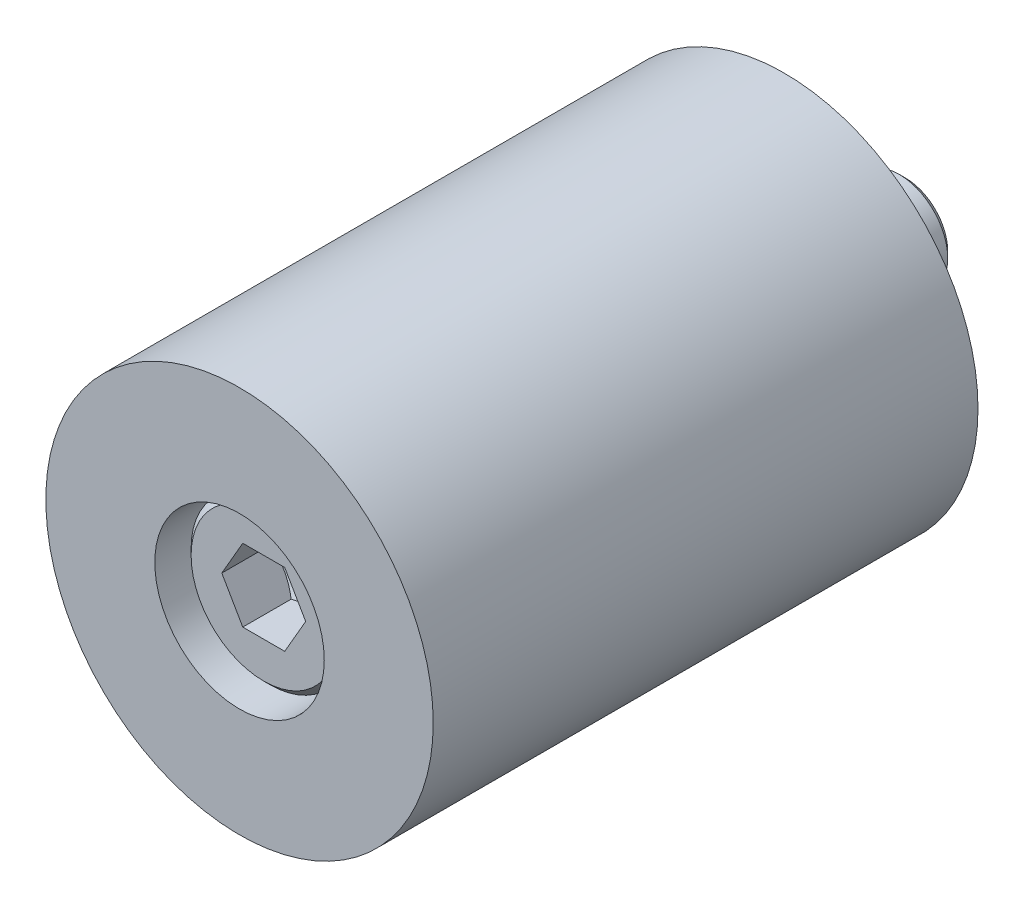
ISO-10303-21;
HEADER;
FILE_DESCRIPTION(('STEP AP214'),'2;1');
FILE_NAME('part.step','',(''),(''),'','','');
FILE_SCHEMA(('AUTOMOTIVE_DESIGN { 1 0 10303 214 1 1 1 1 }'));
ENDSEC;
DATA;
#1=APPLICATION_CONTEXT('core data for automotive mechanical design processes');
#2=APPLICATION_PROTOCOL_DEFINITION('international standard','automotive_design',2000,#1);
#3=PRODUCT_CONTEXT('',#1,'mechanical');
#4=PRODUCT('Part','Part','',(#3));
#5=PRODUCT_RELATED_PRODUCT_CATEGORY('part','',(#4));
#6=PRODUCT_DEFINITION_FORMATION('','',#4);
#7=PRODUCT_DEFINITION_CONTEXT('part definition',#1,'design');
#8=PRODUCT_DEFINITION('design','',#6,#7);
#9=PRODUCT_DEFINITION_SHAPE('','',#8);
#10=(LENGTH_UNIT() NAMED_UNIT(*) SI_UNIT(.MILLI.,.METRE.));
#11=(NAMED_UNIT(*) PLANE_ANGLE_UNIT() SI_UNIT($,.RADIAN.));
#12=(NAMED_UNIT(*) SI_UNIT($,.STERADIAN.) SOLID_ANGLE_UNIT());
#13=UNCERTAINTY_MEASURE_WITH_UNIT(LENGTH_MEASURE(1.E-05),#10,'distance_accuracy_value','');
#14=(GEOMETRIC_REPRESENTATION_CONTEXT(3) GLOBAL_UNCERTAINTY_ASSIGNED_CONTEXT((#13)) GLOBAL_UNIT_ASSIGNED_CONTEXT((#10,
#11,#12)) REPRESENTATION_CONTEXT('',''));
#15=CARTESIAN_POINT('',(0.,0.,0.));
#16=DIRECTION('',(0.,0.,1.));
#17=DIRECTION('',(1.,0.,0.));
#18=AXIS2_PLACEMENT_3D('',#15,#16,#17);
#19=CARTESIAN_POINT('',(0.,0.,22.5));
#20=DIRECTION('',(0.,0.,-1.));
#21=DIRECTION('',(1.,0.,0.));
#22=AXIS2_PLACEMENT_3D('',#19,#20,#21);
#23=CYLINDRICAL_SURFACE('',#22,4.25);
#24=CARTESIAN_POINT('',(0.,0.,35.));
#25=DIRECTION('',(0.,0.,1.));
#26=DIRECTION('',(-1.,0.,0.));
#27=AXIS2_PLACEMENT_3D('',#24,#25,#26);
#28=CIRCLE('',#27,4.25);
#29=CARTESIAN_POINT('',(-4.25,0.,35.));
#30=VERTEX_POINT('',#29);
#31=CARTESIAN_POINT('',(4.25,0.,35.));
#32=VERTEX_POINT('',#31);
#33=EDGE_CURVE('P0_E36',#30,#32,#28,.T.);
#34=ORIENTED_EDGE('',*,*,#33,.T.);
#35=CARTESIAN_POINT('',(4.25,0.,35.0000013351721));
#36=CARTESIAN_POINT('',(4.25,0.,4.55130932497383E-07));
#37=B_SPLINE_CURVE_WITH_KNOTS('',1,(#35,#36),.UNSPECIFIED.,.F.,.F.,(2,2),(0.0833333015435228,
0.916666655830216),.UNSPECIFIED.);
#38=CARTESIAN_POINT('',(4.25,0.,0.));
#39=VERTEX_POINT('',#38);
#40=EDGE_CURVE('P0_E25',#32,#39,#37,.T.);
#41=ORIENTED_EDGE('',*,*,#40,.T.);
#42=CARTESIAN_POINT('',(0.,0.,0.));
#43=DIRECTION('',(0.,0.,1.));
#44=DIRECTION('',(1.,0.,0.));
#45=AXIS2_PLACEMENT_3D('',#42,#43,#44);
#46=CIRCLE('',#45,4.25);
#47=EDGE_CURVE('P0_E11',#39,#39,#46,.T.);
#48=ORIENTED_EDGE('',*,*,#47,.F.);
#49=ORIENTED_EDGE('',*,*,#40,.F.);
#50=CARTESIAN_POINT('',(0.,0.,35.));
#51=DIRECTION('',(0.,0.,1.));
#52=DIRECTION('',(-1.,0.,0.));
#53=AXIS2_PLACEMENT_3D('',#50,#51,#52);
#54=CIRCLE('',#53,4.25);
#55=EDGE_CURVE('P0_E51',#32,#30,#54,.T.);
#56=ORIENTED_EDGE('',*,*,#55,.T.);
#57=EDGE_LOOP('',(#34,#41,#48,#49,#56));
#58=FACE_BOUND('',#57,.T.);
#59=ADVANCED_FACE('P0_F16',(#58),#23,.F.);
#60=CARTESIAN_POINT('',(0.,0.,40.));
#61=DIRECTION('',(0.,0.,-1.));
#62=DIRECTION('',(1.,0.,0.));
#63=AXIS2_PLACEMENT_3D('',#60,#61,#62);
#64=CYLINDRICAL_SURFACE('',#63,7.);
#65=CARTESIAN_POINT('',(0.,0.,45.));
#66=DIRECTION('',(0.,0.,-1.));
#67=DIRECTION('',(1.,0.,0.));
#68=AXIS2_PLACEMENT_3D('',#65,#66,#67);
#69=CIRCLE('',#68,7.);
#70=CARTESIAN_POINT('',(7.,0.,45.));
#71=VERTEX_POINT('',#70);
#72=EDGE_CURVE('P0_E53',#71,#71,#69,.T.);
#73=ORIENTED_EDGE('',*,*,#72,.F.);
#74=CARTESIAN_POINT('',(7.,0.,45.0000015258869));
#75=CARTESIAN_POINT('',(7.,0.,35.0000012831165));
#76=B_SPLINE_CURVE_WITH_KNOTS('',1,(#74,#75),.UNSPECIFIED.,.F.,.F.,(2,2),(0.0833332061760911,
0.916666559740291),.UNSPECIFIED.);
#77=CARTESIAN_POINT('',(7.,0.,35.));
#78=VERTEX_POINT('',#77);
#79=EDGE_CURVE('P0_E91',#71,#78,#76,.T.);
#80=ORIENTED_EDGE('',*,*,#79,.T.);
#81=CARTESIAN_POINT('',(0.,0.,35.));
#82=DIRECTION('',(0.,0.,-1.));
#83=DIRECTION('',(1.,0.,0.));
#84=AXIS2_PLACEMENT_3D('',#81,#82,#83);
#85=CIRCLE('',#84,7.);
#86=EDGE_CURVE('P0_E94',#78,#78,#85,.T.);
#87=ORIENTED_EDGE('',*,*,#86,.T.);
#88=ORIENTED_EDGE('',*,*,#79,.F.);
#89=EDGE_LOOP('',(#73,#80,#87,#88));
#90=FACE_BOUND('',#89,.T.);
#91=ADVANCED_FACE('P0_F111',(#90),#64,.F.);
#92=CARTESIAN_POINT('',(-16.1,14.5492267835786,35.));
#93=DIRECTION('',(0.,0.,-1.));
#94=DIRECTION('',(1.,0.,0.));
#95=AXIS2_PLACEMENT_3D('',#92,#93,#94);
#96=PLANE('',#95);
#97=ORIENTED_EDGE('',*,*,#86,.F.);
#98=EDGE_LOOP('',(#97));
#99=FACE_BOUND('',#98,.T.);
#100=ORIENTED_EDGE('',*,*,#55,.F.);
#101=ORIENTED_EDGE('',*,*,#33,.F.);
#102=EDGE_LOOP('',(#100,#101));
#103=FACE_BOUND('',#102,.T.);
#104=ADVANCED_FACE('P0_F55',(#99,#103),#96,.F.);
#105=CARTESIAN_POINT('',(0.,0.,22.5));
#106=DIRECTION('',(0.,0.,1.));
#107=DIRECTION('',(1.,0.,0.));
#108=AXIS2_PLACEMENT_3D('',#105,#106,#107);
#109=CYLINDRICAL_SURFACE('',#108,16.);
#110=CARTESIAN_POINT('',(0.,0.,0.));
#111=DIRECTION('',(0.,0.,-1.));
#112=DIRECTION('',(1.,0.,0.));
#113=AXIS2_PLACEMENT_3D('',#110,#111,#112);
#114=CIRCLE('',#113,16.);
#115=CARTESIAN_POINT('',(16.,0.,0.));
#116=VERTEX_POINT('',#115);
#117=EDGE_CURVE('P0_E85',#116,#116,#114,.T.);
#118=ORIENTED_EDGE('',*,*,#117,.F.);
#119=CARTESIAN_POINT('',(16.,0.,8.58270883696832E-07));
#120=CARTESIAN_POINT('',(16.,0.,44.9999996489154));
#121=B_SPLINE_CURVE_WITH_KNOTS('',1,(#119,#120),.UNSPECIFIED.,.F.,.F.,(2,2),(0.0833333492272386,
0.916666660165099),.UNSPECIFIED.);
#122=CARTESIAN_POINT('',(16.,0.,45.));
#123=VERTEX_POINT('',#122);
#124=EDGE_CURVE('P0_E57',#116,#123,#121,.T.);
#125=ORIENTED_EDGE('',*,*,#124,.T.);
#126=CARTESIAN_POINT('',(0.,0.,45.));
#127=DIRECTION('',(0.,0.,1.));
#128=DIRECTION('',(1.,0.,0.));
#129=AXIS2_PLACEMENT_3D('',#126,#127,#128);
#130=CIRCLE('',#129,16.);
#131=EDGE_CURVE('P0_E82',#123,#123,#130,.T.);
#132=ORIENTED_EDGE('',*,*,#131,.F.);
#133=ORIENTED_EDGE('',*,*,#124,.F.);
#134=EDGE_LOOP('',(#118,#125,#132,#133));
#135=FACE_BOUND('',#134,.T.);
#136=ADVANCED_FACE('P0_F130',(#135),#109,.T.);
#137=CARTESIAN_POINT('',(20.8,-33.2553755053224,0.));
#138=DIRECTION('',(0.,0.,-1.));
#139=DIRECTION('',(-1.,0.,0.));
#140=AXIS2_PLACEMENT_3D('',#137,#138,#139);
#141=PLANE('',#140);
#142=ORIENTED_EDGE('',*,*,#117,.T.);
#143=EDGE_LOOP('',(#142));
#144=FACE_BOUND('',#143,.T.);
#145=ORIENTED_EDGE('',*,*,#47,.T.);
#146=EDGE_LOOP('',(#145));
#147=FACE_BOUND('',#146,.T.);
#148=ADVANCED_FACE('P0_F132',(#144,#147),#141,.T.);
#149=CARTESIAN_POINT('',(-36.8,-33.2553755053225,45.));
#150=DIRECTION('',(0.,0.,1.));
#151=DIRECTION('',(1.,0.,0.));
#152=AXIS2_PLACEMENT_3D('',#149,#150,#151);
#153=PLANE('',#152);
#154=ORIENTED_EDGE('',*,*,#131,.T.);
#155=EDGE_LOOP('',(#154));
#156=FACE_BOUND('',#155,.T.);
#157=ORIENTED_EDGE('',*,*,#72,.T.);
#158=EDGE_LOOP('',(#157));
#159=FACE_BOUND('',#158,.T.);
#160=ADVANCED_FACE('P0_F108',(#156,#159),#153,.T.);
#161=CLOSED_SHELL('',(#59,#91,#104,#136,#148,#160));
#162=MANIFOLD_SOLID_BREP('P0_B1',#161);
#163=CARTESIAN_POINT('',(0.,0.,-7.84314575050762));
#164=DIRECTION('',(0.,0.,1.));
#165=DIRECTION('',(-1.,0.,0.));
#166=AXIS2_PLACEMENT_3D('',#163,#164,#165);
#167=CONICAL_SURFACE('',#166,5.65685424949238,0.785398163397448);
#168=CARTESIAN_POINT('',(0.,0.,-10.));
#169=DIRECTION('',(0.,0.,1.));
#170=DIRECTION('',(1.,0.,0.));
#171=AXIS2_PLACEMENT_3D('',#168,#169,#170);
#172=CIRCLE('',#171,3.5);
#173=CARTESIAN_POINT('',(3.5,0.,-10.));
#174=VERTEX_POINT('',#173);
#175=CARTESIAN_POINT('',(-3.5,0.,-10.));
#176=VERTEX_POINT('',#175);
#177=EDGE_CURVE('P1_E37',#174,#176,#172,.T.);
#178=ORIENTED_EDGE('',*,*,#177,.T.);
#179=CARTESIAN_POINT('',(-3.50000107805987,0.,-9.99999892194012));
#180=CARTESIAN_POINT('',(-3.9999982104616,0.,-9.5000017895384));
#181=B_SPLINE_CURVE_WITH_KNOTS('',1,(#179,#180),.UNSPECIFIED.,.F.,.F.,(2,2),(0.618718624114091,
0.707106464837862),.UNSPECIFIED.);
#182=CARTESIAN_POINT('',(-4.,0.,-9.5));
#183=VERTEX_POINT('',#182);
#184=EDGE_CURVE('P1_E24',#176,#183,#181,.T.);
#185=ORIENTED_EDGE('',*,*,#184,.T.);
#186=CARTESIAN_POINT('',(0.,0.,-9.5));
#187=DIRECTION('',(0.,0.,-1.));
#188=DIRECTION('',(1.,0.,0.));
#189=AXIS2_PLACEMENT_3D('',#186,#187,#188);
#190=CIRCLE('',#189,4.);
#191=CARTESIAN_POINT('',(4.,0.,-9.5));
#192=VERTEX_POINT('',#191);
#193=EDGE_CURVE('P1_E173',#183,#192,#190,.T.);
#194=ORIENTED_EDGE('',*,*,#193,.T.);
#195=CARTESIAN_POINT('',(0.,0.,-9.5));
#196=DIRECTION('',(0.,0.,-1.));
#197=DIRECTION('',(1.,0.,0.));
#198=AXIS2_PLACEMENT_3D('',#195,#196,#197);
#199=CIRCLE('',#198,4.);
#200=EDGE_CURVE('P1_E10',#192,#183,#199,.T.);
#201=ORIENTED_EDGE('',*,*,#200,.T.);
#202=ORIENTED_EDGE('',*,*,#184,.F.);
#203=CARTESIAN_POINT('',(0.,0.,-10.));
#204=DIRECTION('',(0.,0.,1.));
#205=DIRECTION('',(1.,0.,0.));
#206=AXIS2_PLACEMENT_3D('',#203,#204,#205);
#207=CIRCLE('',#206,3.5);
#208=EDGE_CURVE('P1_E146',#176,#174,#207,.T.);
#209=ORIENTED_EDGE('',*,*,#208,.T.);
#210=EDGE_LOOP('',(#178,#185,#194,#201,#202,#209));
#211=FACE_BOUND('',#210,.T.);
#212=ADVANCED_FACE('P1_F15',(#211),#167,.T.);
#213=CARTESIAN_POINT('',(0.,0.,12.5));
#214=DIRECTION('',(0.,0.,-1.));
#215=DIRECTION('',(1.,0.,0.));
#216=AXIS2_PLACEMENT_3D('',#213,#214,#215);
#217=CYLINDRICAL_SURFACE('',#216,4.);
#218=CARTESIAN_POINT('',(0.,0.,35.));
#219=DIRECTION('',(0.,0.,1.));
#220=DIRECTION('',(1.,0.,0.));
#221=AXIS2_PLACEMENT_3D('',#218,#219,#220);
#222=CIRCLE('',#221,4.);
#223=CARTESIAN_POINT('',(4.,0.,35.));
#224=VERTEX_POINT('',#223);
#225=EDGE_CURVE('P1_E154',#224,#224,#222,.T.);
#226=ORIENTED_EDGE('',*,*,#225,.F.);
#227=CARTESIAN_POINT('',(4.,0.,34.9999991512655));
#228=CARTESIAN_POINT('',(4.,0.,-9.49999965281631));
#229=B_SPLINE_CURVE_WITH_KNOTS('',1,(#227,#228),.UNSPECIFIED.,.F.,.F.,(2,2),(0.0833333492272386,
0.916666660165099),.UNSPECIFIED.);
#230=EDGE_CURVE('P1_E127',#224,#192,#229,.T.);
#231=ORIENTED_EDGE('',*,*,#230,.T.);
#232=ORIENTED_EDGE('',*,*,#193,.F.);
#233=ORIENTED_EDGE('',*,*,#200,.F.);
#234=ORIENTED_EDGE('',*,*,#230,.F.);
#235=EDGE_LOOP('',(#226,#231,#232,#233,#234));
#236=FACE_BOUND('',#235,.T.);
#237=ADVANCED_FACE('P1_F337',(#236),#217,.T.);
#238=CARTESIAN_POINT('',(-8.05,7.27461339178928,-10.));
#239=DIRECTION('',(0.,0.,-1.));
#240=DIRECTION('',(1.,0.,0.));
#241=AXIS2_PLACEMENT_3D('',#238,#239,#240);
#242=PLANE('',#241);
#243=ORIENTED_EDGE('',*,*,#208,.F.);
#244=ORIENTED_EDGE('',*,*,#177,.F.);
#245=EDGE_LOOP('',(#243,#244));
#246=FACE_BOUND('',#245,.T.);
#247=ADVANCED_FACE('P1_F340',(#246),#242,.T.);
#248=CARTESIAN_POINT('',(0.,0.,39.8076118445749));
#249=DIRECTION('',(0.,0.,-1.));
#250=DIRECTION('',(-1.,0.,0.));
#251=AXIS2_PLACEMENT_3D('',#248,#249,#250);
#252=CONICAL_SURFACE('',#251,9.19238815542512,0.785398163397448);
#253=CARTESIAN_POINT('',(0.,0.,43.));
#254=DIRECTION('',(0.,0.,-1.));
#255=DIRECTION('',(1.,0.,0.));
#256=AXIS2_PLACEMENT_3D('',#253,#254,#255);
#257=CIRCLE('',#256,6.);
#258=CARTESIAN_POINT('',(6.,0.,43.));
#259=VERTEX_POINT('',#258);
#260=CARTESIAN_POINT('',(-6.,0.,43.));
#261=VERTEX_POINT('',#260);
#262=EDGE_CURVE('P1_E102',#259,#261,#257,.T.);
#263=ORIENTED_EDGE('',*,*,#262,.T.);
#264=CARTESIAN_POINT('',(-6.00000188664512,0.,42.9999981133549));
#265=CARTESIAN_POINT('',(-6.50000263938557,0.,42.4999973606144));
#266=B_SPLINE_CURVE_WITH_KNOTS('',1,(#264,#265),.UNSPECIFIED.,.F.,.F.,(2,2),(0.652714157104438,
0.707107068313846),.UNSPECIFIED.);
#267=CARTESIAN_POINT('',(-6.5,0.,42.5));
#268=VERTEX_POINT('',#267);
#269=EDGE_CURVE('P1_E107',#261,#268,#266,.T.);
#270=ORIENTED_EDGE('',*,*,#269,.T.);
#271=CARTESIAN_POINT('',(0.,0.,42.5));
#272=DIRECTION('',(0.,0.,1.));
#273=DIRECTION('',(1.,0.,0.));
#274=AXIS2_PLACEMENT_3D('',#271,#272,#273);
#275=CIRCLE('',#274,6.5);
#276=CARTESIAN_POINT('',(6.5,0.,42.5));
#277=VERTEX_POINT('',#276);
#278=EDGE_CURVE('P1_E117',#268,#277,#275,.T.);
#279=ORIENTED_EDGE('',*,*,#278,.T.);
#280=CARTESIAN_POINT('',(0.,0.,42.5));
#281=DIRECTION('',(0.,0.,1.));
#282=DIRECTION('',(1.,0.,0.));
#283=AXIS2_PLACEMENT_3D('',#280,#281,#282);
#284=CIRCLE('',#283,6.5);
#285=EDGE_CURVE('P1_E119',#277,#268,#284,.T.);
#286=ORIENTED_EDGE('',*,*,#285,.T.);
#287=ORIENTED_EDGE('',*,*,#269,.F.);
#288=CARTESIAN_POINT('',(0.,0.,43.));
#289=DIRECTION('',(0.,0.,-1.));
#290=DIRECTION('',(1.,0.,0.));
#291=AXIS2_PLACEMENT_3D('',#288,#289,#290);
#292=CIRCLE('',#291,6.);
#293=EDGE_CURVE('P1_E109',#261,#259,#292,.T.);
#294=ORIENTED_EDGE('',*,*,#293,.T.);
#295=EDGE_LOOP('',(#263,#270,#279,#286,#287,#294));
#296=FACE_BOUND('',#295,.T.);
#297=ADVANCED_FACE('P1_F104',(#296),#252,.T.);
#298=CARTESIAN_POINT('',(0.,0.,39.));
#299=DIRECTION('',(0.,0.,1.));
#300=DIRECTION('',(1.,0.,0.));
#301=AXIS2_PLACEMENT_3D('',#298,#299,#300);
#302=CYLINDRICAL_SURFACE('',#301,6.5);
#303=CARTESIAN_POINT('',(0.,0.,35.));
#304=DIRECTION('',(0.,0.,-1.));
#305=DIRECTION('',(1.,0.,0.));
#306=AXIS2_PLACEMENT_3D('',#303,#304,#305);
#307=CIRCLE('',#306,6.5);
#308=CARTESIAN_POINT('',(6.5,0.,35.));
#309=VERTEX_POINT('',#308);
#310=EDGE_CURVE('P1_E112',#309,#309,#307,.T.);
#311=ORIENTED_EDGE('',*,*,#310,.F.);
#312=CARTESIAN_POINT('',(6.5,0.,35.0000038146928));
#313=CARTESIAN_POINT('',(6.5,0.,42.499997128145));
#314=B_SPLINE_CURVE_WITH_KNOTS('',1,(#312,#313),.UNSPECIFIED.,.F.,.F.,(2,2),(0.0833337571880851,
0.916666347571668),.UNSPECIFIED.);
#315=EDGE_CURVE('P1_E317',#309,#277,#314,.T.);
#316=ORIENTED_EDGE('',*,*,#315,.T.);
#317=ORIENTED_EDGE('',*,*,#278,.F.);
#318=ORIENTED_EDGE('',*,*,#285,.F.);
#319=ORIENTED_EDGE('',*,*,#315,.F.);
#320=EDGE_LOOP('',(#311,#316,#317,#318,#319));
#321=FACE_BOUND('',#320,.T.);
#322=ADVANCED_FACE('P1_F348',(#321),#302,.T.);
#323=CARTESIAN_POINT('',(-13.8,-12.4707658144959,43.));
#324=DIRECTION('',(0.,0.,1.));
#325=DIRECTION('',(1.,0.,0.));
#326=AXIS2_PLACEMENT_3D('',#323,#324,#325);
#327=PLANE('',#326);
#328=ORIENTED_EDGE('',*,*,#293,.F.);
#329=ORIENTED_EDGE('',*,*,#262,.F.);
#330=EDGE_LOOP('',(#328,#329));
#331=FACE_BOUND('',#330,.T.);
#332=DIRECTION('',(-0.500000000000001,0.866025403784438,0.));
#333=VECTOR('',#332,1.);
#334=CARTESIAN_POINT('',(-1.73205080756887,-3.,43.));
#335=LINE('',#334,#333);
#336=CARTESIAN_POINT('',(-1.73205080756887,-3.,43.));
#337=VERTEX_POINT('',#336);
#338=CARTESIAN_POINT('',(-3.46410161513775,0.,43.));
#339=VERTEX_POINT('',#338);
#340=EDGE_CURVE('P1_E312',#337,#339,#335,.T.);
#341=ORIENTED_EDGE('',*,*,#340,.T.);
#342=DIRECTION('',(0.5,0.866025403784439,0.));
#343=VECTOR('',#342,1.);
#344=CARTESIAN_POINT('',(-3.46410161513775,0.,43.));
#345=LINE('',#344,#343);
#346=CARTESIAN_POINT('',(-1.73205080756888,3.,43.));
#347=VERTEX_POINT('',#346);
#348=EDGE_CURVE('P1_E306',#339,#347,#345,.T.);
#349=ORIENTED_EDGE('',*,*,#348,.T.);
#350=DIRECTION('',(1.,0.,0.));
#351=VECTOR('',#350,1.);
#352=CARTESIAN_POINT('',(-1.73205080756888,3.,43.));
#353=LINE('',#352,#351);
#354=CARTESIAN_POINT('',(1.73205080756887,3.,43.));
#355=VERTEX_POINT('',#354);
#356=EDGE_CURVE('P1_E300',#347,#355,#353,.T.);
#357=ORIENTED_EDGE('',*,*,#356,.T.);
#358=DIRECTION('',(0.500000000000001,-0.866025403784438,0.));
#359=VECTOR('',#358,1.);
#360=CARTESIAN_POINT('',(1.73205080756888,3.,43.));
#361=LINE('',#360,#359);
#362=CARTESIAN_POINT('',(3.46410161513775,0.,43.));
#363=VERTEX_POINT('',#362);
#364=EDGE_CURVE('P1_E294',#355,#363,#361,.T.);
#365=ORIENTED_EDGE('',*,*,#364,.T.);
#366=DIRECTION('',(-0.499999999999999,-0.866025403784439,0.));
#367=VECTOR('',#366,1.);
#368=CARTESIAN_POINT('',(3.46410161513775,0.,43.));
#369=LINE('',#368,#367);
#370=CARTESIAN_POINT('',(1.73205080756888,-3.,43.));
#371=VERTEX_POINT('',#370);
#372=EDGE_CURVE('P1_E288',#363,#371,#369,.T.);
#373=ORIENTED_EDGE('',*,*,#372,.T.);
#374=DIRECTION('',(-1.,0.,0.));
#375=VECTOR('',#374,1.);
#376=CARTESIAN_POINT('',(1.73205080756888,-3.,43.));
#377=LINE('',#376,#375);
#378=EDGE_CURVE('P1_E277',#371,#337,#377,.T.);
#379=ORIENTED_EDGE('',*,*,#378,.T.);
#380=EDGE_LOOP('',(#341,#349,#357,#365,#373,#379));
#381=FACE_BOUND('',#380,.T.);
#382=ADVANCED_FACE('P1_F114',(#331,#381),#327,.T.);
#383=CARTESIAN_POINT('',(0.,0.,39.6720470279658));
#384=DIRECTION('',(0.,0.,1.));
#385=DIRECTION('',(-1.,0.,0.));
#386=AXIS2_PLACEMENT_3D('',#383,#384,#385);
#387=CONICAL_SURFACE('',#386,4.58257569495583,1.02974425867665);
#388=CARTESIAN_POINT('',(0.,0.,36.928557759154));
#389=DIRECTION('',(0.,0.,-1.));
#390=DIRECTION('',(-1.,0.,0.));
#391=AXIS2_PLACEMENT_3D('',#388,#389,#390);
#392=CIRCLE('',#391,0.0166427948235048);
#393=CARTESIAN_POINT('',(-0.0166427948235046,0.,36.928557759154));
#394=VERTEX_POINT('',#393);
#395=EDGE_CURVE('P1_E216',#394,#394,#392,.T.);
#396=ORIENTED_EDGE('',*,*,#395,.T.);
#397=CARTESIAN_POINT('',(-0.0166455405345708,0.,36.9285594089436));
#398=CARTESIAN_POINT('',(-3.46410186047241,0.,39.0000001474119));
#399=B_SPLINE_CURVE_WITH_KNOTS('',1,(#397,#398),.UNSPECIFIED.,.F.,.F.,(2,2),(0.0036323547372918,
0.755928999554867),.UNSPECIFIED.);
#400=CARTESIAN_POINT('',(-3.46410161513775,0.,39.));
#401=VERTEX_POINT('',#400);
#402=EDGE_CURVE('P1_E221',#394,#401,#399,.T.);
#403=ORIENTED_EDGE('',*,*,#402,.T.);
#404=CARTESIAN_POINT('',(-3.46410161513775,0.,39.));
#405=CARTESIAN_POINT('',(-2.59807621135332,-1.5,38.4796394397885));
#406=CARTESIAN_POINT('',(-1.73205080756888,-3.,39.));
#407=(BOUNDED_CURVE() B_SPLINE_CURVE(2,(#404,#405,#406),.UNSPECIFIED.,.F.,
.F.) B_SPLINE_CURVE_WITH_KNOTS((3,3),(0.,3.50871093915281),
.UNSPECIFIED.) CURVE() GEOMETRIC_REPRESENTATION_ITEM() RATIONAL_B_SPLINE_CURVE((1.,
1.15470053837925,1.)) REPRESENTATION_ITEM(''));
#408=CARTESIAN_POINT('',(-1.73205080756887,-3.,39.));
#409=VERTEX_POINT('',#408);
#410=EDGE_CURVE('P1_E227',#401,#409,#407,.T.);
#411=ORIENTED_EDGE('',*,*,#410,.T.);
#412=CARTESIAN_POINT('',(-1.73205080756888,-3.,39.));
#413=CARTESIAN_POINT('',(0.,-3.,38.4796394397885));
#414=CARTESIAN_POINT('',(1.73205080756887,-3.,39.));
#415=(BOUNDED_CURVE() B_SPLINE_CURVE(2,(#412,#413,#414),.UNSPECIFIED.,.F.,
.F.) B_SPLINE_CURVE_WITH_KNOTS((3,3),(0.,3.50871093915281),
.UNSPECIFIED.) CURVE() GEOMETRIC_REPRESENTATION_ITEM() RATIONAL_B_SPLINE_CURVE((1.,
1.15470053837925,1.)) REPRESENTATION_ITEM(''));
#416=CARTESIAN_POINT('',(1.73205080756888,-3.,39.));
#417=VERTEX_POINT('',#416);
#418=EDGE_CURVE('P1_E224',#409,#417,#415,.T.);
#419=ORIENTED_EDGE('',*,*,#418,.T.);
#420=CARTESIAN_POINT('',(1.73205080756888,-3.,39.));
#421=CARTESIAN_POINT('',(2.59807621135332,-1.5,38.4796394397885));
#422=CARTESIAN_POINT('',(3.46410161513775,0.,39.));
#423=(BOUNDED_CURVE() B_SPLINE_CURVE(2,(#420,#421,#422),.UNSPECIFIED.,.F.,
.F.) B_SPLINE_CURVE_WITH_KNOTS((3,3),(0.,3.50871093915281),
.UNSPECIFIED.) CURVE() GEOMETRIC_REPRESENTATION_ITEM() RATIONAL_B_SPLINE_CURVE((1.,
1.15470053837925,1.)) REPRESENTATION_ITEM(''));
#424=CARTESIAN_POINT('',(3.46410161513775,0.,39.));
#425=VERTEX_POINT('',#424);
#426=EDGE_CURVE('P1_E267',#417,#425,#423,.T.);
#427=ORIENTED_EDGE('',*,*,#426,.T.);
#428=CARTESIAN_POINT('',(3.46410161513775,0.,39.));
#429=CARTESIAN_POINT('',(2.59807621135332,1.5,38.4796394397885));
#430=CARTESIAN_POINT('',(1.73205080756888,3.,39.));
#431=(BOUNDED_CURVE() B_SPLINE_CURVE(2,(#428,#429,#430),.UNSPECIFIED.,.F.,
.F.) B_SPLINE_CURVE_WITH_KNOTS((3,3),(0.,3.50871093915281),
.UNSPECIFIED.) CURVE() GEOMETRIC_REPRESENTATION_ITEM() RATIONAL_B_SPLINE_CURVE((1.,
1.15470053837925,1.)) REPRESENTATION_ITEM(''));
#432=CARTESIAN_POINT('',(1.73205080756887,3.,39.));
#433=VERTEX_POINT('',#432);
#434=EDGE_CURVE('P1_E257',#425,#433,#431,.T.);
#435=ORIENTED_EDGE('',*,*,#434,.T.);
#436=CARTESIAN_POINT('',(1.73205080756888,3.,39.));
#437=CARTESIAN_POINT('',(0.,3.,38.4796394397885));
#438=CARTESIAN_POINT('',(-1.73205080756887,3.,39.));
#439=(BOUNDED_CURVE() B_SPLINE_CURVE(2,(#436,#437,#438),.UNSPECIFIED.,.F.,
.F.) B_SPLINE_CURVE_WITH_KNOTS((3,3),(0.,3.50871093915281),
.UNSPECIFIED.) CURVE() GEOMETRIC_REPRESENTATION_ITEM() RATIONAL_B_SPLINE_CURVE((1.,
1.15470053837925,1.)) REPRESENTATION_ITEM(''));
#440=CARTESIAN_POINT('',(-1.73205080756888,3.,39.));
#441=VERTEX_POINT('',#440);
#442=EDGE_CURVE('P1_E247',#433,#441,#439,.T.);
#443=ORIENTED_EDGE('',*,*,#442,.T.);
#444=CARTESIAN_POINT('',(-1.73205080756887,3.,39.));
#445=CARTESIAN_POINT('',(-2.59807621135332,1.5,38.4796394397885));
#446=CARTESIAN_POINT('',(-3.46410161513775,0.,39.));
#447=(BOUNDED_CURVE() B_SPLINE_CURVE(2,(#444,#445,#446),.UNSPECIFIED.,.F.,
.F.) B_SPLINE_CURVE_WITH_KNOTS((3,3),(0.,3.50871093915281),
.UNSPECIFIED.) CURVE() GEOMETRIC_REPRESENTATION_ITEM() RATIONAL_B_SPLINE_CURVE((1.,
1.15470053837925,1.)) REPRESENTATION_ITEM(''));
#448=EDGE_CURVE('P1_E237',#441,#401,#447,.T.);
#449=ORIENTED_EDGE('',*,*,#448,.T.);
#450=ORIENTED_EDGE('',*,*,#402,.F.);
#451=EDGE_LOOP('',(#396,#403,#411,#419,#427,#435,#443,#449,#450));
#452=FACE_BOUND('',#451,.T.);
#453=ADVANCED_FACE('P1_F390',(#452),#387,.F.);
#454=CARTESIAN_POINT('',(0.0382784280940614,-0.0345913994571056,36.928557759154));
#455=DIRECTION('',(0.,0.,-1.));
#456=DIRECTION('',(-1.,0.,0.));
#457=AXIS2_PLACEMENT_3D('',#454,#455,#456);
#458=PLANE('',#457);
#459=ORIENTED_EDGE('',*,*,#395,.F.);
#460=EDGE_LOOP('',(#459));
#461=FACE_BOUND('',#460,.T.);
#462=ADVANCED_FACE('P1_F398',(#461),#458,.F.);
#463=CARTESIAN_POINT('',(-1.55884572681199,-3.3,43.4520360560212));
#464=DIRECTION('',(-0.866025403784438,-0.500000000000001,0.));
#465=DIRECTION('',(-0.500000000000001,0.866025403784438,0.));
#466=AXIS2_PLACEMENT_3D('',#463,#464,#465);
#467=PLANE('',#466);
#468=DIRECTION('',(0.,0.,-1.));
#469=VECTOR('',#468,1.);
#470=CARTESIAN_POINT('',(-3.46410161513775,0.,43.));
#471=LINE('',#470,#469);
#472=EDGE_CURVE('P1_E210',#339,#401,#471,.T.);
#473=ORIENTED_EDGE('',*,*,#472,.F.);
#474=ORIENTED_EDGE('',*,*,#340,.F.);
#475=DIRECTION('',(0.,0.,-1.));
#476=VECTOR('',#475,1.);
#477=CARTESIAN_POINT('',(-1.73205080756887,-3.,43.));
#478=LINE('',#477,#476);
#479=EDGE_CURVE('P1_E204',#337,#409,#478,.T.);
#480=ORIENTED_EDGE('',*,*,#479,.T.);
#481=ORIENTED_EDGE('',*,*,#410,.F.);
#482=EDGE_LOOP('',(#473,#474,#480,#481));
#483=FACE_BOUND('',#482,.T.);
#484=ADVANCED_FACE('P1_F407',(#483),#467,.F.);
#485=CARTESIAN_POINT('',(2.07846096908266,-3.,43.4520360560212));
#486=DIRECTION('',(0.,-1.,0.));
#487=DIRECTION('',(-1.,0.,0.));
#488=AXIS2_PLACEMENT_3D('',#485,#486,#487);
#489=PLANE('',#488);
#490=ORIENTED_EDGE('',*,*,#479,.F.);
#491=ORIENTED_EDGE('',*,*,#378,.F.);
#492=DIRECTION('',(0.,0.,-1.));
#493=VECTOR('',#492,1.);
#494=CARTESIAN_POINT('',(1.73205080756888,-3.,43.));
#495=LINE('',#494,#493);
#496=EDGE_CURVE('P1_E198',#371,#417,#495,.T.);
#497=ORIENTED_EDGE('',*,*,#496,.T.);
#498=ORIENTED_EDGE('',*,*,#418,.F.);
#499=EDGE_LOOP('',(#490,#491,#497,#498));
#500=FACE_BOUND('',#499,.T.);
#501=ADVANCED_FACE('P1_F416',(#500),#489,.F.);
#502=CARTESIAN_POINT('',(3.63730669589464,0.300000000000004,43.4520360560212));
#503=DIRECTION('',(0.866025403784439,-0.499999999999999,0.));
#504=DIRECTION('',(-0.499999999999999,-0.866025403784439,0.));
#505=AXIS2_PLACEMENT_3D('',#502,#503,#504);
#506=PLANE('',#505);
#507=ORIENTED_EDGE('',*,*,#496,.F.);
#508=ORIENTED_EDGE('',*,*,#372,.F.);
#509=DIRECTION('',(0.,0.,-1.));
#510=VECTOR('',#509,1.);
#511=CARTESIAN_POINT('',(3.46410161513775,0.,43.));
#512=LINE('',#511,#510);
#513=EDGE_CURVE('P1_E192',#363,#425,#512,.T.);
#514=ORIENTED_EDGE('',*,*,#513,.T.);
#515=ORIENTED_EDGE('',*,*,#426,.F.);
#516=EDGE_LOOP('',(#507,#508,#514,#515));
#517=FACE_BOUND('',#516,.T.);
#518=ADVANCED_FACE('P1_F425',(#517),#506,.F.);
#519=CARTESIAN_POINT('',(1.55884572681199,3.3,43.4520360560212));
#520=DIRECTION('',(0.866025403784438,0.500000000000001,0.));
#521=DIRECTION('',(0.500000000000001,-0.866025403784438,0.));
#522=AXIS2_PLACEMENT_3D('',#519,#520,#521);
#523=PLANE('',#522);
#524=ORIENTED_EDGE('',*,*,#513,.F.);
#525=ORIENTED_EDGE('',*,*,#364,.F.);
#526=DIRECTION('',(0.,0.,-1.));
#527=VECTOR('',#526,1.);
#528=CARTESIAN_POINT('',(1.73205080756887,3.,43.));
#529=LINE('',#528,#527);
#530=EDGE_CURVE('P1_E186',#355,#433,#529,.T.);
#531=ORIENTED_EDGE('',*,*,#530,.T.);
#532=ORIENTED_EDGE('',*,*,#434,.F.);
#533=EDGE_LOOP('',(#524,#525,#531,#532));
#534=FACE_BOUND('',#533,.T.);
#535=ADVANCED_FACE('P1_F434',(#534),#523,.F.);
#536=CARTESIAN_POINT('',(-2.07846096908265,3.,43.4520360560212));
#537=DIRECTION('',(0.,1.,0.));
#538=DIRECTION('',(1.,0.,0.));
#539=AXIS2_PLACEMENT_3D('',#536,#537,#538);
#540=PLANE('',#539);
#541=ORIENTED_EDGE('',*,*,#530,.F.);
#542=ORIENTED_EDGE('',*,*,#356,.F.);
#543=DIRECTION('',(0.,0.,-1.));
#544=VECTOR('',#543,1.);
#545=CARTESIAN_POINT('',(-1.73205080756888,3.,43.));
#546=LINE('',#545,#544);
#547=EDGE_CURVE('P1_E178',#347,#441,#546,.T.);
#548=ORIENTED_EDGE('',*,*,#547,.T.);
#549=ORIENTED_EDGE('',*,*,#442,.F.);
#550=EDGE_LOOP('',(#541,#542,#548,#549));
#551=FACE_BOUND('',#550,.T.);
#552=ADVANCED_FACE('P1_F443',(#551),#540,.F.);
#553=CARTESIAN_POINT('',(-3.63730669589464,-0.300000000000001,43.4520360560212));
#554=DIRECTION('',(-0.866025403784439,0.5,0.));
#555=DIRECTION('',(0.5,0.866025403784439,0.));
#556=AXIS2_PLACEMENT_3D('',#553,#554,#555);
#557=PLANE('',#556);
#558=ORIENTED_EDGE('',*,*,#547,.F.);
#559=ORIENTED_EDGE('',*,*,#348,.F.);
#560=ORIENTED_EDGE('',*,*,#472,.T.);
#561=ORIENTED_EDGE('',*,*,#448,.F.);
#562=EDGE_LOOP('',(#558,#559,#560,#561));
#563=FACE_BOUND('',#562,.T.);
#564=ADVANCED_FACE('P1_F452',(#563),#557,.F.);
#565=CARTESIAN_POINT('',(8.45,-13.5099962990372,35.));
#566=DIRECTION('',(0.,0.,-1.));
#567=DIRECTION('',(-1.,0.,0.));
#568=AXIS2_PLACEMENT_3D('',#565,#566,#567);
#569=PLANE('',#568);
#570=ORIENTED_EDGE('',*,*,#310,.T.);
#571=EDGE_LOOP('',(#570));
#572=FACE_BOUND('',#571,.T.);
#573=ORIENTED_EDGE('',*,*,#225,.T.);
#574=EDGE_LOOP('',(#573));
#575=FACE_BOUND('',#574,.T.);
#576=ADVANCED_FACE('P1_F336',(#572,#575),#569,.T.);
#577=CLOSED_SHELL('',(#212,#237,#247,#297,#322,#382,#453,#462,#484,#501,#518,#535,#552,#564,#576));
#578=MANIFOLD_SOLID_BREP('P1_B1',#577);
#579=ADVANCED_BREP_SHAPE_REPRESENTATION('',(#18,#162,#578),#14);
#580=SHAPE_DEFINITION_REPRESENTATION(#9,#579);
ENDSEC;
END-ISO-10303-21;
